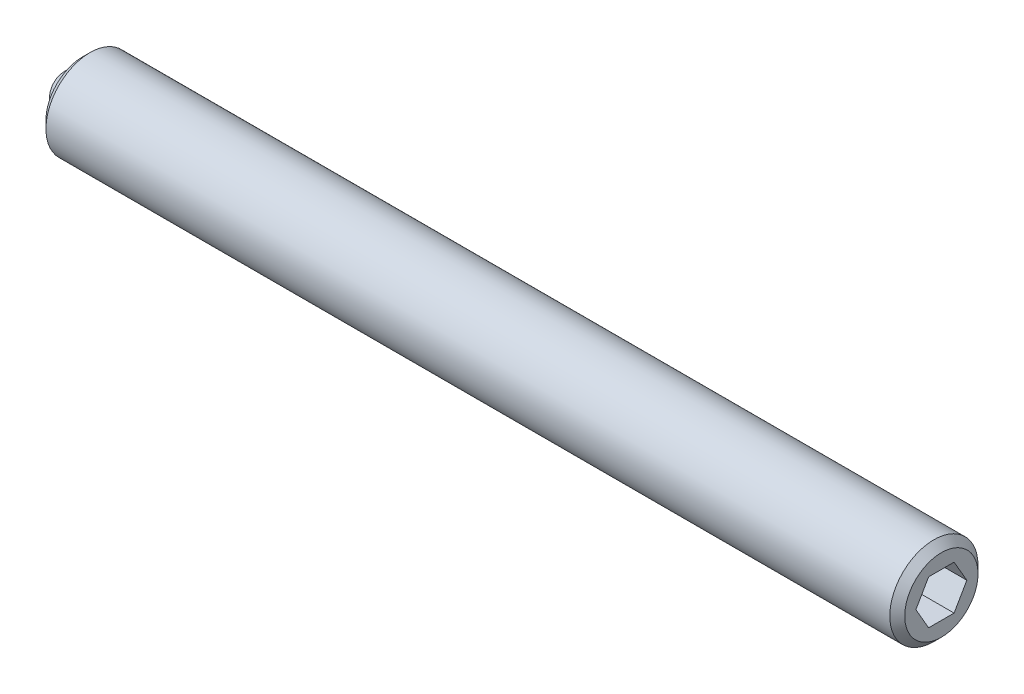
from build123d import *

# Parameters (mm, degrees)
SKETCH2_R           = 1.5
BOSS_EXTRUDE1_DEPTH = 29.2
CHAMFER1_SIZE       = 0.254
CHAMFER2_SIZE       = 0.254
CUT_EXTRUDE2_DEPTH  = 2
SKETCH3_R           = 0.8
CUT_EXTRUDE3_DEPTH  = 0.8


with BuildPart() as part:
    # Sketch2 → Boss-Extrude1 (new body)
    with BuildSketch(Plane(origin=(0, 0, 0), x_dir=(0, 0, -1), z_dir=(1, 0, 0))):
        Circle(SKETCH2_R)
    extrude(amount=BOSS_EXTRUDE1_DEPTH)

    # Chamfer1
    chamfer1_edges = [part.edges().sort_by_distance(p)[0] for p in [
        (0, 0, 1.5),
    ]]
    chamfer(chamfer1_edges, length=CHAMFER1_SIZE)

    # Chamfer2
    chamfer2_edges = [part.edges().sort_by_distance(p)[0] for p in [
        (29.2, 0, 1.5),
    ]]
    chamfer(chamfer2_edges, length=CHAMFER2_SIZE)

    # Sketch4 → Cut-Extrude2 (cut)
    with BuildSketch(Plane(origin=(29.2, 0, 0), x_dir=(0, 0, -1), z_dir=(1, 0, 0))):
        Polygon((0.866025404, 0), (0.433012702, 0.75), (-0.433012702, 0.75), (-0.866025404, 0), (-0.433012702, -0.75), (0.433012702, -0.75), align=None)
    extrude(amount=-CUT_EXTRUDE2_DEPTH, mode=Mode.SUBTRACT)

    # Sketch3 → Cut-Extrude3 (cut)
    with BuildSketch(Plane.ZY):
        Circle(SKETCH3_R)
    extrude(amount=-CUT_EXTRUDE3_DEPTH, mode=Mode.SUBTRACT)


with BuildPart() as body_2:
    # Sketch5 → Revolve1 (revolve)
    with BuildSketch(Plane.ZY):
        with BuildLine():
            Line((0, 0), (0, -0.8))
            ThreePointArc((0, -0.8), (-0.8, 0), (0, 0.8))
            Line((0, 0.8), (0, 0))
        make_face()
    revolve(axis=Axis((0, 0, 0), (0, 1, 0)))


solid = Compound([part.part, body_2.part])
